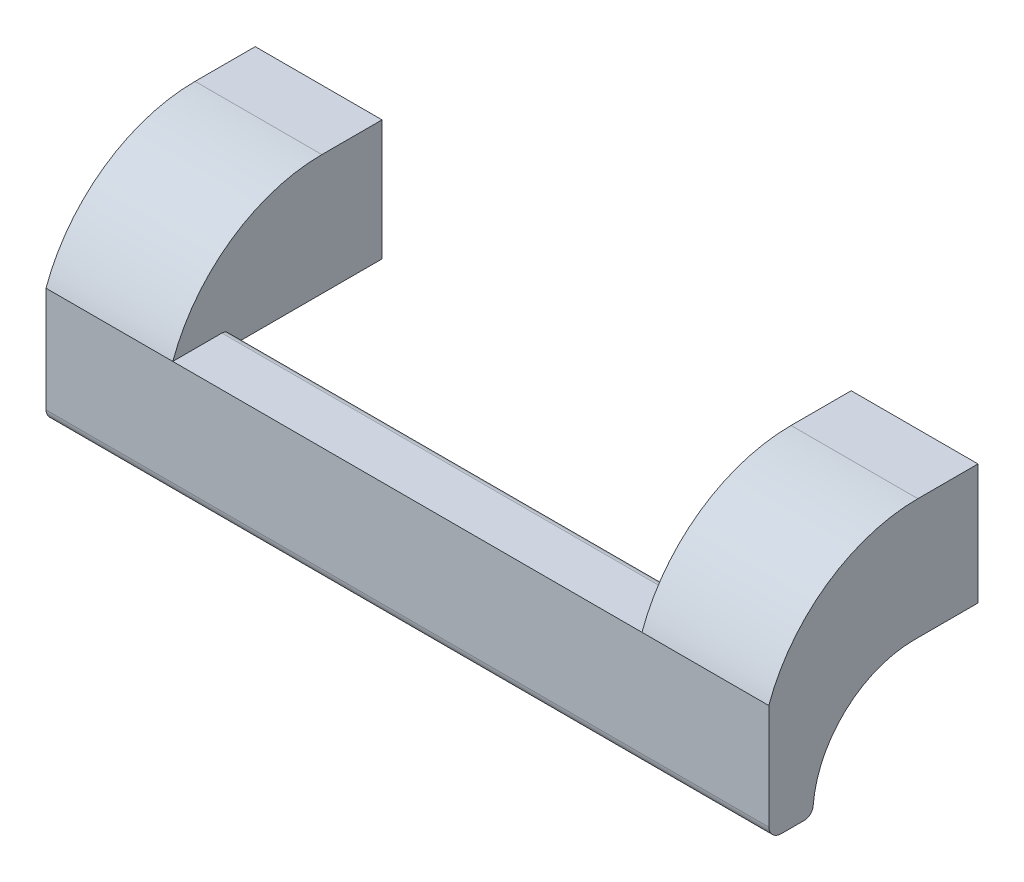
ISO-10303-21;
HEADER;
FILE_DESCRIPTION(('STEP AP214'),'2;1');
FILE_NAME('part.step','',(''),(''),'','','');
FILE_SCHEMA(('AUTOMOTIVE_DESIGN { 1 0 10303 214 1 1 1 1 }'));
ENDSEC;
DATA;
#1=APPLICATION_CONTEXT('core data for automotive mechanical design processes');
#2=APPLICATION_PROTOCOL_DEFINITION('international standard','automotive_design',2000,#1);
#3=PRODUCT_CONTEXT('',#1,'mechanical');
#4=PRODUCT('Part','Part','',(#3));
#5=PRODUCT_RELATED_PRODUCT_CATEGORY('part','',(#4));
#6=PRODUCT_DEFINITION_FORMATION('','',#4);
#7=PRODUCT_DEFINITION_CONTEXT('part definition',#1,'design');
#8=PRODUCT_DEFINITION('design','',#6,#7);
#9=PRODUCT_DEFINITION_SHAPE('','',#8);
#10=(LENGTH_UNIT() NAMED_UNIT(*) SI_UNIT(.MILLI.,.METRE.));
#11=(NAMED_UNIT(*) PLANE_ANGLE_UNIT() SI_UNIT($,.RADIAN.));
#12=(NAMED_UNIT(*) SI_UNIT($,.STERADIAN.) SOLID_ANGLE_UNIT());
#13=UNCERTAINTY_MEASURE_WITH_UNIT(LENGTH_MEASURE(1.E-05),#10,'distance_accuracy_value','');
#14=(GEOMETRIC_REPRESENTATION_CONTEXT(3) GLOBAL_UNCERTAINTY_ASSIGNED_CONTEXT((#13)) GLOBAL_UNIT_ASSIGNED_CONTEXT((#10,
#11,#12)) REPRESENTATION_CONTEXT('',''));
#15=CARTESIAN_POINT('',(0.,0.,0.));
#16=DIRECTION('',(0.,0.,1.));
#17=DIRECTION('',(1.,0.,0.));
#18=AXIS2_PLACEMENT_3D('',#15,#16,#17);
#19=CARTESIAN_POINT('',(93.5,8.66025403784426,11.));
#20=DIRECTION('',(0.,0.,-1.));
#21=DIRECTION('',(0.,1.,0.));
#22=AXIS2_PLACEMENT_3D('',#19,#20,#21);
#23=PLANE('',#22);
#24=DIRECTION('',(0.5,0.866025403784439,0.));
#25=VECTOR('',#24,1.);
#26=CARTESIAN_POINT('',(99.2735026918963,2.09368185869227E-13,11.));
#27=LINE('',#26,#25);
#28=CARTESIAN_POINT('',(99.2735026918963,1.88847396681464E-13,11.));
#29=VERTEX_POINT('',#28);
#30=CARTESIAN_POINT('',(96.3867513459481,-4.99999999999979,11.0000000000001));
#31=VERTEX_POINT('',#30);
#32=EDGE_CURVE('E454',#29,#31,#27,.F.);
#33=ORIENTED_EDGE('',*,*,#32,.T.);
#34=DIRECTION('',(1.,0.,0.));
#35=VECTOR('',#34,1.);
#36=CARTESIAN_POINT('',(96.3867513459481,-4.99999999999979,11.0000000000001));
#37=LINE('',#36,#35);
#38=CARTESIAN_POINT('',(90.6132486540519,-4.9999999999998,11.0000000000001));
#39=VERTEX_POINT('',#38);
#40=EDGE_CURVE('E447',#31,#39,#37,.F.);
#41=ORIENTED_EDGE('',*,*,#40,.T.);
#42=DIRECTION('',(0.5,-0.866025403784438,0.));
#43=VECTOR('',#42,1.);
#44=CARTESIAN_POINT('',(90.6132486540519,-4.99999999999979,11.0000000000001));
#45=LINE('',#44,#43);
#46=CARTESIAN_POINT('',(87.7264973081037,2.07278833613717E-13,11.0000000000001));
#47=VERTEX_POINT('',#46);
#48=EDGE_CURVE('E222',#39,#47,#45,.F.);
#49=ORIENTED_EDGE('',*,*,#48,.T.);
#50=DIRECTION('',(-0.5,-0.866025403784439,0.));
#51=VECTOR('',#50,1.);
#52=CARTESIAN_POINT('',(87.7264973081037,2.24980697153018E-13,11.));
#53=LINE('',#52,#51);
#54=CARTESIAN_POINT('',(90.6132486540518,5.00000000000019,11.));
#55=VERTEX_POINT('',#54);
#56=EDGE_CURVE('E217',#47,#55,#53,.F.);
#57=ORIENTED_EDGE('',*,*,#56,.T.);
#58=DIRECTION('',(1.,0.,0.));
#59=VECTOR('',#58,1.);
#60=CARTESIAN_POINT('',(90.6132486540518,5.00000000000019,10.9999999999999));
#61=LINE('',#60,#59);
#62=CARTESIAN_POINT('',(96.3867513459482,5.00000000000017,10.9999999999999));
#63=VERTEX_POINT('',#62);
#64=EDGE_CURVE('E219',#55,#63,#61,.T.);
#65=ORIENTED_EDGE('',*,*,#64,.T.);
#66=DIRECTION('',(-0.499999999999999,0.866025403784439,0.));
#67=VECTOR('',#66,1.);
#68=CARTESIAN_POINT('',(96.3867513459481,5.00000000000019,10.9999999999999));
#69=LINE('',#68,#67);
#70=EDGE_CURVE('E461',#63,#29,#69,.F.);
#71=ORIENTED_EDGE('',*,*,#70,.T.);
#72=EDGE_LOOP('',(#33,#41,#49,#57,#65,#71));
#73=FACE_BOUND('',#72,.T.);
#74=ADVANCED_FACE('F14',(#73),#23,.T.);
#75=CARTESIAN_POINT('',(0.,8.66025403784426,11.));
#76=DIRECTION('',(0.,0.,-1.));
#77=DIRECTION('',(0.,1.,0.));
#78=AXIS2_PLACEMENT_3D('',#75,#76,#77);
#79=PLANE('',#78);
#80=DIRECTION('',(0.5,0.866025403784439,0.));
#81=VECTOR('',#80,1.);
#82=CARTESIAN_POINT('',(5.77350269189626,2.16740760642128E-13,11.));
#83=LINE('',#82,#81);
#84=CARTESIAN_POINT('',(5.77350269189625,1.98001642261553E-13,11.));
#85=VERTEX_POINT('',#84);
#86=CARTESIAN_POINT('',(2.88675134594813,-4.99999999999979,11.0000000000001));
#87=VERTEX_POINT('',#86);
#88=EDGE_CURVE('E414',#85,#87,#83,.F.);
#89=ORIENTED_EDGE('',*,*,#88,.T.);
#90=DIRECTION('',(1.,0.,0.));
#91=VECTOR('',#90,1.);
#92=CARTESIAN_POINT('',(2.88675134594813,-4.99999999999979,11.0000000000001));
#93=LINE('',#92,#91);
#94=CARTESIAN_POINT('',(-2.88675134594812,-4.9999999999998,11.0000000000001));
#95=VERTEX_POINT('',#94);
#96=EDGE_CURVE('E407',#87,#95,#93,.F.);
#97=ORIENTED_EDGE('',*,*,#96,.T.);
#98=DIRECTION('',(0.5,-0.866025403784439,0.));
#99=VECTOR('',#98,1.);
#100=CARTESIAN_POINT('',(-2.88675134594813,-4.99999999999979,11.0000000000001));
#101=LINE('',#100,#99);
#102=CARTESIAN_POINT('',(-5.77350269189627,2.00686988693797E-13,11.0000000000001));
#103=VERTEX_POINT('',#102);
#104=EDGE_CURVE('E401',#95,#103,#101,.F.);
#105=ORIENTED_EDGE('',*,*,#104,.T.);
#106=DIRECTION('',(-0.5,-0.866025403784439,0.));
#107=VECTOR('',#106,1.);
#108=CARTESIAN_POINT('',(-5.77350269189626,2.18475484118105E-13,11.));
#109=LINE('',#108,#107);
#110=CARTESIAN_POINT('',(-2.88675134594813,5.00000000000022,11.));
#111=VERTEX_POINT('',#110);
#112=EDGE_CURVE('E435',#103,#111,#109,.F.);
#113=ORIENTED_EDGE('',*,*,#112,.T.);
#114=DIRECTION('',(1.,0.,0.));
#115=VECTOR('',#114,1.);
#116=CARTESIAN_POINT('',(-2.88675134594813,5.00000000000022,10.9999999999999));
#117=LINE('',#116,#115);
#118=CARTESIAN_POINT('',(2.88675134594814,5.0000000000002,10.9999999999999));
#119=VERTEX_POINT('',#118);
#120=EDGE_CURVE('E428',#111,#119,#117,.T.);
#121=ORIENTED_EDGE('',*,*,#120,.T.);
#122=DIRECTION('',(-0.5,0.866025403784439,0.));
#123=VECTOR('',#122,1.);
#124=CARTESIAN_POINT('',(2.88675134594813,5.00000000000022,10.9999999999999));
#125=LINE('',#124,#123);
#126=EDGE_CURVE('E421',#119,#85,#125,.F.);
#127=ORIENTED_EDGE('',*,*,#126,.T.);
#128=EDGE_LOOP('',(#89,#97,#105,#113,#121,#127));
#129=FACE_BOUND('',#128,.T.);
#130=ADVANCED_FACE('F1110',(#129),#79,.T.);
#131=CARTESIAN_POINT('',(87.7264973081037,2.24980697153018E-13,11.));
#132=DIRECTION('',(-0.866025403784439,0.5,0.));
#133=DIRECTION('',(-0.5,-0.866025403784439,0.));
#134=AXIS2_PLACEMENT_3D('',#131,#132,#133);
#135=PLANE('',#134);
#136=DIRECTION('',(0.,0.,1.));
#137=VECTOR('',#136,1.);
#138=CARTESIAN_POINT('',(90.6132486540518,5.00000000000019,10.9999999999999));
#139=LINE('',#138,#137);
#140=CARTESIAN_POINT('',(90.6132486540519,5.00000000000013,5.99999999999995));
#141=VERTEX_POINT('',#140);
#142=EDGE_CURVE('E228',#141,#55,#139,.T.);
#143=ORIENTED_EDGE('',*,*,#142,.T.);
#144=ORIENTED_EDGE('',*,*,#56,.F.);
#145=DIRECTION('',(0.,0.,1.));
#146=VECTOR('',#145,1.);
#147=CARTESIAN_POINT('',(87.7264973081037,2.25514051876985E-13,11.0000000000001));
#148=LINE('',#147,#146);
#149=CARTESIAN_POINT('',(87.7264973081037,1.44794539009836E-13,6.));
#150=VERTEX_POINT('',#149);
#151=EDGE_CURVE('E438',#47,#150,#148,.F.);
#152=ORIENTED_EDGE('',*,*,#151,.T.);
#153=DIRECTION('',(0.5,0.866025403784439,0.));
#154=VECTOR('',#153,1.);
#155=CARTESIAN_POINT('',(87.7264973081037,1.26634813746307E-13,6.00000000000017));
#156=LINE('',#155,#154);
#157=EDGE_CURVE('E240',#150,#141,#156,.T.);
#158=ORIENTED_EDGE('',*,*,#157,.T.);
#159=EDGE_LOOP('',(#143,#144,#152,#158));
#160=FACE_BOUND('',#159,.T.);
#161=ADVANCED_FACE('F239',(#160),#135,.F.);
#162=CARTESIAN_POINT('',(90.6132486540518,5.00000000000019,10.9999999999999));
#163=DIRECTION('',(0.,1.,0.));
#164=DIRECTION('',(0.,0.,1.));
#165=AXIS2_PLACEMENT_3D('',#162,#163,#164);
#166=PLANE('',#165);
#167=DIRECTION('',(0.,0.,1.));
#168=VECTOR('',#167,1.);
#169=CARTESIAN_POINT('',(96.3867513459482,5.00000000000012,10.9999999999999));
#170=LINE('',#169,#168);
#171=CARTESIAN_POINT('',(96.3867513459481,5.0000000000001,5.99999999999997));
#172=VERTEX_POINT('',#171);
#173=EDGE_CURVE('E235',#172,#63,#170,.T.);
#174=ORIENTED_EDGE('',*,*,#173,.T.);
#175=ORIENTED_EDGE('',*,*,#64,.F.);
#176=ORIENTED_EDGE('',*,*,#142,.F.);
#177=DIRECTION('',(1.,0.,0.));
#178=VECTOR('',#177,1.);
#179=CARTESIAN_POINT('',(93.5,5.0000000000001,6.00000000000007));
#180=LINE('',#179,#178);
#181=EDGE_CURVE('E392',#141,#172,#180,.T.);
#182=ORIENTED_EDGE('',*,*,#181,.T.);
#183=EDGE_LOOP('',(#174,#175,#176,#182));
#184=FACE_BOUND('',#183,.T.);
#185=ADVANCED_FACE('F232',(#184),#166,.F.);
#186=CARTESIAN_POINT('',(96.3867513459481,5.00000000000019,10.9999999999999));
#187=DIRECTION('',(0.866025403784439,0.499999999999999,0.));
#188=DIRECTION('',(-0.499999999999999,0.866025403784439,0.));
#189=AXIS2_PLACEMENT_3D('',#186,#187,#188);
#190=PLANE('',#189);
#191=DIRECTION('',(0.,0.,1.));
#192=VECTOR('',#191,1.);
#193=CARTESIAN_POINT('',(99.2735026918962,1.35183598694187E-13,11.));
#194=LINE('',#193,#192);
#195=CARTESIAN_POINT('',(99.2735026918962,1.45285381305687E-13,6.00000000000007));
#196=VERTEX_POINT('',#195);
#197=EDGE_CURVE('E457',#196,#29,#194,.T.);
#198=ORIENTED_EDGE('',*,*,#197,.T.);
#199=ORIENTED_EDGE('',*,*,#70,.F.);
#200=ORIENTED_EDGE('',*,*,#173,.F.);
#201=DIRECTION('',(0.500000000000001,-0.866025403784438,0.));
#202=VECTOR('',#201,1.);
#203=CARTESIAN_POINT('',(96.3867513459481,5.0000000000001,6.00000000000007));
#204=LINE('',#203,#202);
#205=EDGE_CURVE('E388',#172,#196,#204,.T.);
#206=ORIENTED_EDGE('',*,*,#205,.T.);
#207=EDGE_LOOP('',(#198,#199,#200,#206));
#208=FACE_BOUND('',#207,.T.);
#209=ADVANCED_FACE('F1086',(#208),#190,.F.);
#210=CARTESIAN_POINT('',(99.2735026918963,2.09368185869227E-13,11.));
#211=DIRECTION('',(0.866025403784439,-0.5,0.));
#212=DIRECTION('',(0.5,0.866025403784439,0.));
#213=AXIS2_PLACEMENT_3D('',#210,#211,#212);
#214=PLANE('',#213);
#215=DIRECTION('',(0.,0.,-1.));
#216=VECTOR('',#215,1.);
#217=CARTESIAN_POINT('',(96.3867513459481,-4.99999999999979,11.0000000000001));
#218=LINE('',#217,#216);
#219=CARTESIAN_POINT('',(96.3867513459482,-4.99999999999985,6.00000000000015));
#220=VERTEX_POINT('',#219);
#221=EDGE_CURVE('E450',#220,#31,#218,.F.);
#222=ORIENTED_EDGE('',*,*,#221,.T.);
#223=ORIENTED_EDGE('',*,*,#32,.F.);
#224=ORIENTED_EDGE('',*,*,#197,.F.);
#225=DIRECTION('',(-0.500000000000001,-0.866025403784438,0.));
#226=VECTOR('',#225,1.);
#227=CARTESIAN_POINT('',(99.2735026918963,1.11022302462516E-13,6.00000000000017));
#228=LINE('',#227,#226);
#229=EDGE_CURVE('E384',#196,#220,#228,.T.);
#230=ORIENTED_EDGE('',*,*,#229,.T.);
#231=EDGE_LOOP('',(#222,#223,#224,#230));
#232=FACE_BOUND('',#231,.T.);
#233=ADVANCED_FACE('F1077',(#232),#214,.F.);
#234=CARTESIAN_POINT('',(96.3867513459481,-4.99999999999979,11.0000000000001));
#235=DIRECTION('',(0.,-1.,0.));
#236=DIRECTION('',(0.,0.,-1.));
#237=AXIS2_PLACEMENT_3D('',#234,#235,#236);
#238=PLANE('',#237);
#239=DIRECTION('',(0.,0.,1.));
#240=VECTOR('',#239,1.);
#241=CARTESIAN_POINT('',(90.6132486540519,-4.99999999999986,11.0000000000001));
#242=LINE('',#241,#240);
#243=CARTESIAN_POINT('',(90.6132486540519,-4.99999999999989,6.00000000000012));
#244=VERTEX_POINT('',#243);
#245=EDGE_CURVE('E443',#244,#39,#242,.T.);
#246=ORIENTED_EDGE('',*,*,#245,.T.);
#247=ORIENTED_EDGE('',*,*,#40,.F.);
#248=ORIENTED_EDGE('',*,*,#221,.F.);
#249=DIRECTION('',(1.,0.,0.));
#250=VECTOR('',#249,1.);
#251=CARTESIAN_POINT('',(93.5,-4.99999999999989,6.00000000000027));
#252=LINE('',#251,#250);
#253=EDGE_CURVE('E380',#220,#244,#252,.F.);
#254=ORIENTED_EDGE('',*,*,#253,.T.);
#255=EDGE_LOOP('',(#246,#247,#248,#254));
#256=FACE_BOUND('',#255,.T.);
#257=ADVANCED_FACE('F1068',(#256),#238,.F.);
#258=CARTESIAN_POINT('',(90.6132486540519,-4.99999999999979,11.0000000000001));
#259=DIRECTION('',(-0.866025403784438,-0.5,0.));
#260=DIRECTION('',(0.5,-0.866025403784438,0.));
#261=AXIS2_PLACEMENT_3D('',#258,#259,#260);
#262=PLANE('',#261);
#263=ORIENTED_EDGE('',*,*,#151,.F.);
#264=ORIENTED_EDGE('',*,*,#48,.F.);
#265=ORIENTED_EDGE('',*,*,#245,.F.);
#266=DIRECTION('',(-0.5,0.866025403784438,0.));
#267=VECTOR('',#266,1.);
#268=CARTESIAN_POINT('',(90.6132486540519,-4.99999999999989,6.00000000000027));
#269=LINE('',#268,#267);
#270=EDGE_CURVE('E376',#244,#150,#269,.T.);
#271=ORIENTED_EDGE('',*,*,#270,.T.);
#272=EDGE_LOOP('',(#263,#264,#265,#271));
#273=FACE_BOUND('',#272,.T.);
#274=ADVANCED_FACE('F1059',(#273),#262,.F.);
#275=CARTESIAN_POINT('',(-5.77350269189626,2.18475484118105E-13,11.));
#276=DIRECTION('',(-0.866025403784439,0.5,0.));
#277=DIRECTION('',(-0.5,-0.866025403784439,0.));
#278=AXIS2_PLACEMENT_3D('',#275,#276,#277);
#279=PLANE('',#278);
#280=DIRECTION('',(0.,0.,1.));
#281=VECTOR('',#280,1.);
#282=CARTESIAN_POINT('',(-2.88675134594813,5.00000000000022,10.9999999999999));
#283=LINE('',#282,#281);
#284=CARTESIAN_POINT('',(-2.88675134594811,5.00000000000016,5.99999999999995));
#285=VERTEX_POINT('',#284);
#286=EDGE_CURVE('E431',#285,#111,#283,.T.);
#287=ORIENTED_EDGE('',*,*,#286,.T.);
#288=ORIENTED_EDGE('',*,*,#112,.F.);
#289=DIRECTION('',(0.,0.,1.));
#290=VECTOR('',#289,1.);
#291=CARTESIAN_POINT('',(-5.77350269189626,2.18575157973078E-13,11.0000000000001));
#292=LINE('',#291,#290);
#293=CARTESIAN_POINT('',(-5.77350269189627,1.38166380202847E-13,6.));
#294=VERTEX_POINT('',#293);
#295=EDGE_CURVE('E397',#103,#294,#292,.F.);
#296=ORIENTED_EDGE('',*,*,#295,.T.);
#297=DIRECTION('',(0.5,0.866025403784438,0.));
#298=VECTOR('',#297,1.);
#299=CARTESIAN_POINT('',(-5.77350269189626,1.196959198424E-13,6.00000000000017));
#300=LINE('',#299,#298);
#301=EDGE_CURVE('E372',#294,#285,#300,.T.);
#302=ORIENTED_EDGE('',*,*,#301,.T.);
#303=EDGE_LOOP('',(#287,#288,#296,#302));
#304=FACE_BOUND('',#303,.T.);
#305=ADVANCED_FACE('F1050',(#304),#279,.F.);
#306=CARTESIAN_POINT('',(-2.88675134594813,5.00000000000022,10.9999999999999));
#307=DIRECTION('',(0.,1.,0.));
#308=DIRECTION('',(0.,0.,1.));
#309=AXIS2_PLACEMENT_3D('',#306,#307,#308);
#310=PLANE('',#309);
#311=DIRECTION('',(0.,0.,1.));
#312=VECTOR('',#311,1.);
#313=CARTESIAN_POINT('',(2.88675134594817,5.00000000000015,10.9999999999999));
#314=LINE('',#313,#312);
#315=CARTESIAN_POINT('',(2.88675134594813,5.00000000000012,5.99999999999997));
#316=VERTEX_POINT('',#315);
#317=EDGE_CURVE('E424',#316,#119,#314,.T.);
#318=ORIENTED_EDGE('',*,*,#317,.T.);
#319=ORIENTED_EDGE('',*,*,#120,.F.);
#320=ORIENTED_EDGE('',*,*,#286,.F.);
#321=DIRECTION('',(1.,0.,0.));
#322=VECTOR('',#321,1.);
#323=CARTESIAN_POINT('',(0.,5.00000000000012,6.00000000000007));
#324=LINE('',#323,#322);
#325=EDGE_CURVE('E369',#285,#316,#324,.T.);
#326=ORIENTED_EDGE('',*,*,#325,.T.);
#327=EDGE_LOOP('',(#318,#319,#320,#326));
#328=FACE_BOUND('',#327,.T.);
#329=ADVANCED_FACE('F1041',(#328),#310,.F.);
#330=CARTESIAN_POINT('',(2.88675134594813,5.00000000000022,10.9999999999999));
#331=DIRECTION('',(0.866025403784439,0.5,0.));
#332=DIRECTION('',(-0.5,0.866025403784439,0.));
#333=AXIS2_PLACEMENT_3D('',#330,#331,#332);
#334=PLANE('',#333);
#335=DIRECTION('',(0.,0.,1.));
#336=VECTOR('',#335,1.);
#337=CARTESIAN_POINT('',(5.77350269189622,1.42556173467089E-13,11.));
#338=LINE('',#337,#336);
#339=CARTESIAN_POINT('',(5.77350269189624,1.54629362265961E-13,6.00000000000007));
#340=VERTEX_POINT('',#339);
#341=EDGE_CURVE('E417',#340,#85,#338,.T.);
#342=ORIENTED_EDGE('',*,*,#341,.T.);
#343=ORIENTED_EDGE('',*,*,#126,.F.);
#344=ORIENTED_EDGE('',*,*,#317,.F.);
#345=DIRECTION('',(0.5,-0.866025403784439,0.));
#346=VECTOR('',#345,1.);
#347=CARTESIAN_POINT('',(2.88675134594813,5.00000000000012,6.00000000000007));
#348=LINE('',#347,#346);
#349=EDGE_CURVE('E366',#316,#340,#348,.T.);
#350=ORIENTED_EDGE('',*,*,#349,.T.);
#351=EDGE_LOOP('',(#342,#343,#344,#350));
#352=FACE_BOUND('',#351,.T.);
#353=ADVANCED_FACE('F1032',(#352),#334,.F.);
#354=CARTESIAN_POINT('',(5.77350269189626,2.16740760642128E-13,11.));
#355=DIRECTION('',(0.866025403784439,-0.5,0.));
#356=DIRECTION('',(0.5,0.866025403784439,0.));
#357=AXIS2_PLACEMENT_3D('',#354,#355,#356);
#358=PLANE('',#357);
#359=DIRECTION('',(0.,0.,-1.));
#360=VECTOR('',#359,1.);
#361=CARTESIAN_POINT('',(2.88675134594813,-4.99999999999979,11.0000000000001));
#362=LINE('',#361,#360);
#363=CARTESIAN_POINT('',(2.88675134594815,-4.99999999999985,6.00000000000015));
#364=VERTEX_POINT('',#363);
#365=EDGE_CURVE('E410',#364,#87,#362,.F.);
#366=ORIENTED_EDGE('',*,*,#365,.T.);
#367=ORIENTED_EDGE('',*,*,#88,.F.);
#368=ORIENTED_EDGE('',*,*,#341,.F.);
#369=DIRECTION('',(-0.5,-0.866025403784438,0.));
#370=VECTOR('',#369,1.);
#371=CARTESIAN_POINT('',(5.77350269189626,1.17961196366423E-13,6.00000000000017));
#372=LINE('',#371,#370);
#373=EDGE_CURVE('E360',#340,#364,#372,.T.);
#374=ORIENTED_EDGE('',*,*,#373,.T.);
#375=EDGE_LOOP('',(#366,#367,#368,#374));
#376=FACE_BOUND('',#375,.T.);
#377=ADVANCED_FACE('F1023',(#376),#358,.F.);
#378=CARTESIAN_POINT('',(2.88675134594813,-4.99999999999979,11.0000000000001));
#379=DIRECTION('',(0.,-1.,0.));
#380=DIRECTION('',(0.,0.,-1.));
#381=AXIS2_PLACEMENT_3D('',#378,#379,#380);
#382=PLANE('',#381);
#383=DIRECTION('',(0.,0.,1.));
#384=VECTOR('',#383,1.);
#385=CARTESIAN_POINT('',(-2.88675134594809,-4.99999999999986,11.0000000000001));
#386=LINE('',#385,#384);
#387=CARTESIAN_POINT('',(-2.88675134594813,-4.99999999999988,6.00000000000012));
#388=VERTEX_POINT('',#387);
#389=EDGE_CURVE('E144',#388,#95,#386,.T.);
#390=ORIENTED_EDGE('',*,*,#389,.T.);
#391=ORIENTED_EDGE('',*,*,#96,.F.);
#392=ORIENTED_EDGE('',*,*,#365,.F.);
#393=DIRECTION('',(1.,0.,0.));
#394=VECTOR('',#393,1.);
#395=CARTESIAN_POINT('',(0.,-4.99999999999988,6.00000000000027));
#396=LINE('',#395,#394);
#397=EDGE_CURVE('E355',#364,#388,#396,.F.);
#398=ORIENTED_EDGE('',*,*,#397,.T.);
#399=EDGE_LOOP('',(#390,#391,#392,#398));
#400=FACE_BOUND('',#399,.T.);
#401=ADVANCED_FACE('F1015',(#400),#382,.F.);
#402=CARTESIAN_POINT('',(-2.88675134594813,-4.99999999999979,11.0000000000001));
#403=DIRECTION('',(-0.866025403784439,-0.5,0.));
#404=DIRECTION('',(0.5,-0.866025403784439,0.));
#405=AXIS2_PLACEMENT_3D('',#402,#403,#404);
#406=PLANE('',#405);
#407=ORIENTED_EDGE('',*,*,#295,.F.);
#408=ORIENTED_EDGE('',*,*,#104,.F.);
#409=ORIENTED_EDGE('',*,*,#389,.F.);
#410=DIRECTION('',(-0.5,0.866025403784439,0.));
#411=VECTOR('',#410,1.);
#412=CARTESIAN_POINT('',(-2.88675134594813,-4.99999999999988,6.00000000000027));
#413=LINE('',#412,#411);
#414=EDGE_CURVE('E349',#388,#294,#413,.T.);
#415=ORIENTED_EDGE('',*,*,#414,.T.);
#416=EDGE_LOOP('',(#407,#408,#409,#415));
#417=FACE_BOUND('',#416,.T.);
#418=ADVANCED_FACE('F778',(#417),#406,.F.);
#419=CARTESIAN_POINT('',(93.5,8.66025403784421,6.));
#420=DIRECTION('',(0.,0.,-1.));
#421=DIRECTION('',(0.,1.,0.));
#422=AXIS2_PLACEMENT_3D('',#419,#420,#421);
#423=PLANE('',#422);
#424=ORIENTED_EDGE('',*,*,#253,.F.);
#425=ORIENTED_EDGE('',*,*,#229,.F.);
#426=ORIENTED_EDGE('',*,*,#205,.F.);
#427=ORIENTED_EDGE('',*,*,#181,.F.);
#428=ORIENTED_EDGE('',*,*,#157,.F.);
#429=ORIENTED_EDGE('',*,*,#270,.F.);
#430=EDGE_LOOP('',(#424,#425,#426,#427,#428,#429));
#431=FACE_BOUND('',#430,.T.);
#432=CARTESIAN_POINT('',(93.5,1.66533453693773E-13,6.0000000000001));
#433=DIRECTION('',(0.,0.,-1.));
#434=DIRECTION('',(0.,1.,0.));
#435=AXIS2_PLACEMENT_3D('',#432,#433,#434);
#436=CIRCLE('',#435,3.24999999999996);
#437=CARTESIAN_POINT('',(93.5,3.25000000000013,6.00000000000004));
#438=VERTEX_POINT('',#437);
#439=EDGE_CURVE('E336',#438,#438,#436,.T.);
#440=ORIENTED_EDGE('',*,*,#439,.T.);
#441=EDGE_LOOP('',(#440));
#442=FACE_BOUND('',#441,.T.);
#443=ADVANCED_FACE('F769',(#431,#442),#423,.F.);
#444=CARTESIAN_POINT('',(0.,8.66025403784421,6.));
#445=DIRECTION('',(0.,0.,-1.));
#446=DIRECTION('',(0.,1.,0.));
#447=AXIS2_PLACEMENT_3D('',#444,#445,#446);
#448=PLANE('',#447);
#449=ORIENTED_EDGE('',*,*,#397,.F.);
#450=ORIENTED_EDGE('',*,*,#373,.F.);
#451=ORIENTED_EDGE('',*,*,#349,.F.);
#452=ORIENTED_EDGE('',*,*,#325,.F.);
#453=ORIENTED_EDGE('',*,*,#301,.F.);
#454=ORIENTED_EDGE('',*,*,#414,.F.);
#455=EDGE_LOOP('',(#449,#450,#451,#452,#453,#454));
#456=FACE_BOUND('',#455,.T.);
#457=CARTESIAN_POINT('',(0.,1.66533453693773E-13,6.0000000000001));
#458=DIRECTION('',(0.,0.,-1.));
#459=DIRECTION('',(0.,1.,0.));
#460=AXIS2_PLACEMENT_3D('',#457,#458,#459);
#461=CIRCLE('',#460,3.24999999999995);
#462=CARTESIAN_POINT('',(0.,3.25000000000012,6.00000000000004));
#463=VERTEX_POINT('',#462);
#464=EDGE_CURVE('E331',#463,#463,#461,.T.);
#465=ORIENTED_EDGE('',*,*,#464,.T.);
#466=EDGE_LOOP('',(#465));
#467=FACE_BOUND('',#466,.T.);
#468=ADVANCED_FACE('F767',(#456,#467),#448,.F.);
#469=CARTESIAN_POINT('',(101.25,-23.,29.5000000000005));
#470=DIRECTION('',(-1.,0.,0.));
#471=DIRECTION('',(0.,0.,1.));
#472=AXIS2_PLACEMENT_3D('',#469,#470,#471);
#473=CYLINDRICAL_SURFACE('',#472,0.500000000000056);
#474=CARTESIAN_POINT('',(-7.75000000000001,-23.,29.5000000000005));
#475=DIRECTION('',(-1.,0.,0.));
#476=DIRECTION('',(0.,0.,1.));
#477=AXIS2_PLACEMENT_3D('',#474,#475,#476);
#478=CIRCLE('',#477,0.500000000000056);
#479=CARTESIAN_POINT('',(-7.75000000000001,-23.,30.0000000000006));
#480=VERTEX_POINT('',#479);
#481=CARTESIAN_POINT('',(-7.75000000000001,-23.4999999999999,29.5000000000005));
#482=VERTEX_POINT('',#481);
#483=EDGE_CURVE('E340',#480,#482,#478,.F.);
#484=ORIENTED_EDGE('',*,*,#483,.F.);
#485=DIRECTION('',(1.,0.,0.));
#486=VECTOR('',#485,1.);
#487=CARTESIAN_POINT('',(101.25,-23.,30.0000000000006));
#488=LINE('',#487,#486);
#489=CARTESIAN_POINT('',(101.25,-23.,30.0000000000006));
#490=VERTEX_POINT('',#489);
#491=EDGE_CURVE('E335',#480,#490,#488,.T.);
#492=ORIENTED_EDGE('',*,*,#491,.T.);
#493=CARTESIAN_POINT('',(101.25,-23.,29.5000000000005));
#494=DIRECTION('',(-1.,0.,0.));
#495=DIRECTION('',(0.,0.,1.));
#496=AXIS2_PLACEMENT_3D('',#493,#494,#495);
#497=CIRCLE('',#496,0.500000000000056);
#498=CARTESIAN_POINT('',(101.25,-23.4999999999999,29.5000000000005));
#499=VERTEX_POINT('',#498);
#500=EDGE_CURVE('E17',#499,#490,#497,.T.);
#501=ORIENTED_EDGE('',*,*,#500,.F.);
#502=DIRECTION('',(1.,0.,0.));
#503=VECTOR('',#502,1.);
#504=CARTESIAN_POINT('',(101.25,-23.4999999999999,29.5000000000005));
#505=LINE('',#504,#503);
#506=EDGE_CURVE('E339',#499,#482,#505,.F.);
#507=ORIENTED_EDGE('',*,*,#506,.T.);
#508=EDGE_LOOP('',(#484,#492,#501,#507));
#509=FACE_BOUND('',#508,.T.);
#510=ADVANCED_FACE('F578',(#509),#473,.F.);
#511=CARTESIAN_POINT('',(101.25,-23.5,26.7117925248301));
#512=DIRECTION('',(0.,-1.,0.));
#513=DIRECTION('',(0.,0.,-1.));
#514=AXIS2_PLACEMENT_3D('',#511,#512,#513);
#515=PLANE('',#514);
#516=DIRECTION('',(0.,0.,1.));
#517=VECTOR('',#516,1.);
#518=CARTESIAN_POINT('',(-7.75,-23.5,29.5000000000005));
#519=LINE('',#518,#517);
#520=CARTESIAN_POINT('',(-7.75000000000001,-23.5,26.7117925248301));
#521=VERTEX_POINT('',#520);
#522=EDGE_CURVE('E503',#521,#482,#519,.T.);
#523=ORIENTED_EDGE('',*,*,#522,.T.);
#524=ORIENTED_EDGE('',*,*,#506,.F.);
#525=DIRECTION('',(0.,0.,1.));
#526=VECTOR('',#525,1.);
#527=CARTESIAN_POINT('',(101.25,-23.5,29.5000000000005));
#528=LINE('',#527,#526);
#529=CARTESIAN_POINT('',(101.25,-23.5,26.7117925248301));
#530=VERTEX_POINT('',#529);
#531=EDGE_CURVE('E557',#530,#499,#528,.T.);
#532=ORIENTED_EDGE('',*,*,#531,.F.);
#533=DIRECTION('',(-1.,0.,0.));
#534=VECTOR('',#533,1.);
#535=CARTESIAN_POINT('',(101.25,-23.5000000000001,26.7117925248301));
#536=LINE('',#535,#534);
#537=EDGE_CURVE('E322',#521,#530,#536,.F.);
#538=ORIENTED_EDGE('',*,*,#537,.F.);
#539=EDGE_LOOP('',(#523,#524,#532,#538));
#540=FACE_BOUND('',#539,.T.);
#541=ADVANCED_FACE('F729',(#540),#515,.F.);
#542=CARTESIAN_POINT('',(93.5,1.66533453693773E-13,6.0000000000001));
#543=DIRECTION('',(0.,0.,-1.));
#544=DIRECTION('',(0.,1.,0.));
#545=AXIS2_PLACEMENT_3D('',#542,#543,#544);
#546=CYLINDRICAL_SURFACE('',#545,3.24999999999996);
#547=CARTESIAN_POINT('',(93.5,0.,0.));
#548=DIRECTION('',(0.,0.,-1.));
#549=DIRECTION('',(0.,1.,0.));
#550=AXIS2_PLACEMENT_3D('',#547,#548,#549);
#551=CIRCLE('',#550,3.24999999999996);
#552=CARTESIAN_POINT('',(93.5,3.25000000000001,0.));
#553=VERTEX_POINT('',#552);
#554=EDGE_CURVE('E309',#553,#553,#551,.F.);
#555=ORIENTED_EDGE('',*,*,#554,.F.);
#556=EDGE_LOOP('',(#555));
#557=FACE_BOUND('',#556,.T.);
#558=ORIENTED_EDGE('',*,*,#439,.F.);
#559=EDGE_LOOP('',(#558));
#560=FACE_BOUND('',#559,.T.);
#561=ADVANCED_FACE('F763',(#557,#560),#546,.F.);
#562=CARTESIAN_POINT('',(0.,1.66533453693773E-13,6.0000000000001));
#563=DIRECTION('',(0.,0.,-1.));
#564=DIRECTION('',(0.,1.,0.));
#565=AXIS2_PLACEMENT_3D('',#562,#563,#564);
#566=CYLINDRICAL_SURFACE('',#565,3.24999999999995);
#567=CARTESIAN_POINT('',(0.,0.,0.));
#568=DIRECTION('',(0.,0.,-1.));
#569=DIRECTION('',(0.,1.,0.));
#570=AXIS2_PLACEMENT_3D('',#567,#568,#569);
#571=CIRCLE('',#570,3.24999999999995);
#572=CARTESIAN_POINT('',(0.,3.25,0.));
#573=VERTEX_POINT('',#572);
#574=EDGE_CURVE('E298',#573,#573,#571,.F.);
#575=ORIENTED_EDGE('',*,*,#574,.F.);
#576=EDGE_LOOP('',(#575));
#577=FACE_BOUND('',#576,.T.);
#578=ORIENTED_EDGE('',*,*,#464,.F.);
#579=EDGE_LOOP('',(#578));
#580=FACE_BOUND('',#579,.T.);
#581=ADVANCED_FACE('F760',(#577,#580),#566,.F.);
#582=CARTESIAN_POINT('',(101.25,-23.,30.0000000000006));
#583=DIRECTION('',(0.,0.,1.));
#584=DIRECTION('',(0.,-1.,0.));
#585=AXIS2_PLACEMENT_3D('',#582,#583,#584);
#586=PLANE('',#585);
#587=DIRECTION('',(0.,1.,0.));
#588=VECTOR('',#587,1.);
#589=CARTESIAN_POINT('',(-7.75,-23.,30.0000000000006));
#590=LINE('',#589,#588);
#591=CARTESIAN_POINT('',(-7.75,-9.4999999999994,30.0000000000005));
#592=VERTEX_POINT('',#591);
#593=EDGE_CURVE('E330',#480,#592,#590,.T.);
#594=ORIENTED_EDGE('',*,*,#593,.T.);
#595=DIRECTION('',(1.,0.,0.));
#596=VECTOR('',#595,1.);
#597=CARTESIAN_POINT('',(-10.25,-9.49999999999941,30.0000000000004));
#598=LINE('',#597,#596);
#599=CARTESIAN_POINT('',(101.25,-9.4999999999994,30.0000000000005));
#600=VERTEX_POINT('',#599);
#601=EDGE_CURVE('E476',#592,#600,#598,.T.);
#602=ORIENTED_EDGE('',*,*,#601,.T.);
#603=DIRECTION('',(0.,1.,0.));
#604=VECTOR('',#603,1.);
#605=CARTESIAN_POINT('',(101.25,-23.,30.0000000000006));
#606=LINE('',#605,#604);
#607=EDGE_CURVE('E505',#490,#600,#606,.T.);
#608=ORIENTED_EDGE('',*,*,#607,.F.);
#609=ORIENTED_EDGE('',*,*,#491,.F.);
#610=EDGE_LOOP('',(#594,#602,#608,#609));
#611=FACE_BOUND('',#610,.T.);
#612=ADVANCED_FACE('F580',(#611),#586,.F.);
#613=CARTESIAN_POINT('',(101.25,-23.,29.5000000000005));
#614=DIRECTION('',(-1.,0.,0.));
#615=DIRECTION('',(0.,0.,1.));
#616=AXIS2_PLACEMENT_3D('',#613,#614,#615);
#617=PLANE('',#616);
#618=DIRECTION('',(0.,0.,1.));
#619=VECTOR('',#618,1.);
#620=CARTESIAN_POINT('',(101.25,-9.5,1.94289029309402E-13));
#621=LINE('',#620,#619);
#622=CARTESIAN_POINT('',(101.25,-9.4999999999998,10.0519430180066));
#623=VERTEX_POINT('',#622);
#624=EDGE_CURVE('E498',#600,#623,#621,.F.);
#625=ORIENTED_EDGE('',*,*,#624,.T.);
#626=CARTESIAN_POINT('',(101.25,-25.5,10.0519430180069));
#627=DIRECTION('',(1.,0.,0.));
#628=DIRECTION('',(0.,0.,-1.));
#629=AXIS2_PLACEMENT_3D('',#626,#627,#628);
#630=CIRCLE('',#629,16.);
#631=CARTESIAN_POINT('',(101.25,-24.2117925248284,26.0000000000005));
#632=VERTEX_POINT('',#631);
#633=EDGE_CURVE('E304',#623,#632,#630,.T.);
#634=ORIENTED_EDGE('',*,*,#633,.T.);
#635=CARTESIAN_POINT('',(101.25,-24.2117925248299,26.7117925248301));
#636=DIRECTION('',(-1.,0.,0.));
#637=DIRECTION('',(0.,0.,1.));
#638=AXIS2_PLACEMENT_3D('',#635,#636,#637);
#639=CIRCLE('',#638,0.711792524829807);
#640=EDGE_CURVE('E327',#530,#632,#639,.T.);
#641=ORIENTED_EDGE('',*,*,#640,.F.);
#642=ORIENTED_EDGE('',*,*,#531,.T.);
#643=ORIENTED_EDGE('',*,*,#500,.T.);
#644=ORIENTED_EDGE('',*,*,#607,.T.);
#645=EDGE_LOOP('',(#625,#634,#641,#642,#643,#644));
#646=FACE_BOUND('',#645,.T.);
#647=ADVANCED_FACE('F583',(#646),#617,.T.);
#648=CARTESIAN_POINT('',(-7.75,-23.,29.5000000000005));
#649=DIRECTION('',(-1.,0.,0.));
#650=DIRECTION('',(0.,0.,1.));
#651=AXIS2_PLACEMENT_3D('',#648,#649,#650);
#652=PLANE('',#651);
#653=DIRECTION('',(0.,0.,1.));
#654=VECTOR('',#653,1.);
#655=CARTESIAN_POINT('',(-7.75,-9.5,1.94289029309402E-13));
#656=LINE('',#655,#654);
#657=CARTESIAN_POINT('',(-7.75,-9.4999999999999,10.0519430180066));
#658=VERTEX_POINT('',#657);
#659=EDGE_CURVE('E474',#658,#592,#656,.T.);
#660=ORIENTED_EDGE('',*,*,#659,.T.);
#661=ORIENTED_EDGE('',*,*,#593,.F.);
#662=ORIENTED_EDGE('',*,*,#483,.T.);
#663=ORIENTED_EDGE('',*,*,#522,.F.);
#664=CARTESIAN_POINT('',(-7.75000000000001,-24.2117925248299,26.7117925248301));
#665=DIRECTION('',(-1.,0.,0.));
#666=DIRECTION('',(0.,0.,1.));
#667=AXIS2_PLACEMENT_3D('',#664,#665,#666);
#668=CIRCLE('',#667,0.711792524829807);
#669=CARTESIAN_POINT('',(-7.75,-24.2117925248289,26.0000000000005));
#670=VERTEX_POINT('',#669);
#671=EDGE_CURVE('E323',#670,#521,#668,.F.);
#672=ORIENTED_EDGE('',*,*,#671,.F.);
#673=CARTESIAN_POINT('',(-7.75,-25.5,10.0519430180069));
#674=DIRECTION('',(1.,0.,0.));
#675=DIRECTION('',(0.,0.,-1.));
#676=AXIS2_PLACEMENT_3D('',#673,#674,#675);
#677=CIRCLE('',#676,16.);
#678=EDGE_CURVE('E292',#670,#658,#677,.F.);
#679=ORIENTED_EDGE('',*,*,#678,.T.);
#680=EDGE_LOOP('',(#660,#661,#662,#663,#672,#679));
#681=FACE_BOUND('',#680,.T.);
#682=ADVANCED_FACE('F730',(#681),#652,.F.);
#683=CARTESIAN_POINT('',(101.25,-24.2117925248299,26.7117925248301));
#684=DIRECTION('',(-1.,0.,0.));
#685=DIRECTION('',(0.,0.,1.));
#686=AXIS2_PLACEMENT_3D('',#683,#684,#685);
#687=CYLINDRICAL_SURFACE('',#686,0.711792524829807);
#688=ORIENTED_EDGE('',*,*,#671,.T.);
#689=ORIENTED_EDGE('',*,*,#537,.T.);
#690=ORIENTED_EDGE('',*,*,#640,.T.);
#691=DIRECTION('',(1.,0.,0.));
#692=VECTOR('',#691,1.);
#693=CARTESIAN_POINT('',(-10.25,-24.2117925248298,26.0000000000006));
#694=LINE('',#693,#692);
#695=EDGE_CURVE('E527',#670,#632,#694,.T.);
#696=ORIENTED_EDGE('',*,*,#695,.F.);
#697=EDGE_LOOP('',(#688,#689,#690,#696));
#698=FACE_BOUND('',#697,.T.);
#699=ADVANCED_FACE('F726',(#698),#687,.T.);
#700=CARTESIAN_POINT('',(83.75,-8.24999999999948,25.2545902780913));
#701=DIRECTION('',(-1.,0.,0.));
#702=DIRECTION('',(0.,0.,1.));
#703=AXIS2_PLACEMENT_3D('',#700,#701,#702);
#704=CYLINDRICAL_SURFACE('',#703,1.25000000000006);
#705=DIRECTION('',(1.,0.,0.));
#706=VECTOR('',#705,1.);
#707=CARTESIAN_POINT('',(83.75,-6.99999999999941,25.2545902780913));
#708=LINE('',#707,#706);
#709=CARTESIAN_POINT('',(83.75,-6.99999999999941,25.2545902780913));
#710=VERTEX_POINT('',#709);
#711=CARTESIAN_POINT('',(9.74999999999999,-6.99999999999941,25.2545902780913));
#712=VERTEX_POINT('',#711);
#713=EDGE_CURVE('E488',#710,#712,#708,.F.);
#714=ORIENTED_EDGE('',*,*,#713,.F.);
#715=CARTESIAN_POINT('',(83.75,-8.24999999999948,25.2545902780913));
#716=DIRECTION('',(-1.,0.,0.));
#717=DIRECTION('',(0.,0.,1.));
#718=AXIS2_PLACEMENT_3D('',#715,#716,#717);
#719=CIRCLE('',#718,1.25000000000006);
#720=CARTESIAN_POINT('',(83.75,-9.4999999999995,25.2545902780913));
#721=VERTEX_POINT('',#720);
#722=EDGE_CURVE('E315',#721,#710,#719,.F.);
#723=ORIENTED_EDGE('',*,*,#722,.F.);
#724=DIRECTION('',(1.,0.,0.));
#725=VECTOR('',#724,1.);
#726=CARTESIAN_POINT('',(-10.25,-9.4999999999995,25.2545902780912));
#727=LINE('',#726,#725);
#728=CARTESIAN_POINT('',(9.75,-9.4999999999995,25.2545902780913));
#729=VERTEX_POINT('',#728);
#730=EDGE_CURVE('E471',#721,#729,#727,.F.);
#731=ORIENTED_EDGE('',*,*,#730,.T.);
#732=CARTESIAN_POINT('',(9.74999999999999,-8.24999999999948,25.2545902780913));
#733=DIRECTION('',(-1.,0.,0.));
#734=DIRECTION('',(0.,0.,1.));
#735=AXIS2_PLACEMENT_3D('',#732,#733,#734);
#736=CIRCLE('',#735,1.25000000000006);
#737=EDGE_CURVE('E318',#729,#712,#736,.F.);
#738=ORIENTED_EDGE('',*,*,#737,.T.);
#739=EDGE_LOOP('',(#714,#723,#731,#738));
#740=FACE_BOUND('',#739,.T.);
#741=ADVANCED_FACE('F748',(#740),#704,.T.);
#742=CARTESIAN_POINT('',(9.75,-8.24999999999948,25.2545902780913));
#743=DIRECTION('',(-1.,0.,0.));
#744=DIRECTION('',(0.,0.,1.));
#745=AXIS2_PLACEMENT_3D('',#742,#743,#744);
#746=PLANE('',#745);
#747=ORIENTED_EDGE('',*,*,#737,.F.);
#748=DIRECTION('',(0.,0.,1.));
#749=VECTOR('',#748,1.);
#750=CARTESIAN_POINT('',(9.75,-9.5,1.94289029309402E-13));
#751=LINE('',#750,#749);
#752=CARTESIAN_POINT('',(9.75,-9.5,1.94289029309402E-13));
#753=VERTEX_POINT('',#752);
#754=EDGE_CURVE('E494',#729,#753,#751,.F.);
#755=ORIENTED_EDGE('',*,*,#754,.T.);
#756=DIRECTION('',(0.,1.,0.));
#757=VECTOR('',#756,1.);
#758=CARTESIAN_POINT('',(9.75,-9.5,1.94289029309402E-13));
#759=LINE('',#758,#757);
#760=CARTESIAN_POINT('',(9.75,9.49999999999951,-1.81190110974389E-13));
#761=VERTEX_POINT('',#760);
#762=EDGE_CURVE('E302',#761,#753,#759,.F.);
#763=ORIENTED_EDGE('',*,*,#762,.F.);
#764=DIRECTION('',(0.,0.,1.));
#765=VECTOR('',#764,1.);
#766=CARTESIAN_POINT('',(9.75,9.49999999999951,-1.80411241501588E-13));
#767=LINE('',#766,#765);
#768=CARTESIAN_POINT('',(9.75,9.49999999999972,9.4893641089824));
#769=VERTEX_POINT('',#768);
#770=EDGE_CURVE('E303',#769,#761,#767,.F.);
#771=ORIENTED_EDGE('',*,*,#770,.F.);
#772=CARTESIAN_POINT('',(9.75,-15.5000000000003,9.48936410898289));
#773=DIRECTION('',(1.,0.,0.));
#774=DIRECTION('',(0.,0.,-1.));
#775=AXIS2_PLACEMENT_3D('',#772,#773,#774);
#776=CIRCLE('',#775,25.);
#777=CARTESIAN_POINT('',(9.75,-6.99999999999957,33.0000000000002));
#778=VERTEX_POINT('',#777);
#779=EDGE_CURVE('E287',#778,#769,#776,.F.);
#780=ORIENTED_EDGE('',*,*,#779,.F.);
#781=DIRECTION('',(0.,0.,1.));
#782=VECTOR('',#781,1.);
#783=CARTESIAN_POINT('',(9.74999999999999,-6.99999999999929,34.2205294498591));
#784=LINE('',#783,#782);
#785=EDGE_CURVE('E286',#712,#778,#784,.T.);
#786=ORIENTED_EDGE('',*,*,#785,.F.);
#787=EDGE_LOOP('',(#747,#755,#763,#771,#780,#786));
#788=FACE_BOUND('',#787,.T.);
#789=ADVANCED_FACE('F751',(#788),#746,.F.);
#790=CARTESIAN_POINT('',(83.75,-8.24999999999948,25.2545902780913));
#791=DIRECTION('',(-1.,0.,0.));
#792=DIRECTION('',(0.,0.,1.));
#793=AXIS2_PLACEMENT_3D('',#790,#791,#792);
#794=PLANE('',#793);
#795=ORIENTED_EDGE('',*,*,#722,.T.);
#796=DIRECTION('',(0.,0.,1.));
#797=VECTOR('',#796,1.);
#798=CARTESIAN_POINT('',(83.75,-6.99999999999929,34.2205294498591));
#799=LINE('',#798,#797);
#800=CARTESIAN_POINT('',(83.75,-6.99999999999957,33.0000000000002));
#801=VERTEX_POINT('',#800);
#802=EDGE_CURVE('E489',#801,#710,#799,.F.);
#803=ORIENTED_EDGE('',*,*,#802,.F.);
#804=CARTESIAN_POINT('',(83.75,-15.5000000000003,9.48936410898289));
#805=DIRECTION('',(1.,0.,0.));
#806=DIRECTION('',(0.,0.,-1.));
#807=AXIS2_PLACEMENT_3D('',#804,#805,#806);
#808=CIRCLE('',#807,25.);
#809=CARTESIAN_POINT('',(83.75,9.49999999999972,9.4893641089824));
#810=VERTEX_POINT('',#809);
#811=EDGE_CURVE('E282',#810,#801,#808,.T.);
#812=ORIENTED_EDGE('',*,*,#811,.F.);
#813=DIRECTION('',(0.,0.,1.));
#814=VECTOR('',#813,1.);
#815=CARTESIAN_POINT('',(83.75,9.49999999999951,-1.80411241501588E-13));
#816=LINE('',#815,#814);
#817=CARTESIAN_POINT('',(83.75,9.49999999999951,-1.81190110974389E-13));
#818=VERTEX_POINT('',#817);
#819=EDGE_CURVE('E314',#818,#810,#816,.T.);
#820=ORIENTED_EDGE('',*,*,#819,.F.);
#821=DIRECTION('',(0.,1.,0.));
#822=VECTOR('',#821,1.);
#823=CARTESIAN_POINT('',(83.75,-9.5,1.94289029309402E-13));
#824=LINE('',#823,#822);
#825=CARTESIAN_POINT('',(83.75,-9.5,1.31838984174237E-13));
#826=VERTEX_POINT('',#825);
#827=EDGE_CURVE('E313',#826,#818,#824,.T.);
#828=ORIENTED_EDGE('',*,*,#827,.F.);
#829=DIRECTION('',(0.,0.,1.));
#830=VECTOR('',#829,1.);
#831=CARTESIAN_POINT('',(83.75,-9.5,1.94289029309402E-13));
#832=LINE('',#831,#830);
#833=EDGE_CURVE('E486',#826,#721,#832,.T.);
#834=ORIENTED_EDGE('',*,*,#833,.T.);
#835=EDGE_LOOP('',(#795,#803,#812,#820,#828,#834));
#836=FACE_BOUND('',#835,.T.);
#837=ADVANCED_FACE('F742',(#836),#794,.T.);
#838=CARTESIAN_POINT('',(-10.25,9.49999999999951,-1.80411241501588E-13));
#839=DIRECTION('',(0.,1.,0.));
#840=DIRECTION('',(0.,0.,1.));
#841=AXIS2_PLACEMENT_3D('',#838,#839,#840);
#842=PLANE('',#841);
#843=DIRECTION('',(1.,0.,0.));
#844=VECTOR('',#843,1.);
#845=CARTESIAN_POINT('',(-10.25,9.49999999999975,9.48936410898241));
#846=LINE('',#845,#844);
#847=CARTESIAN_POINT('',(103.75,9.49999999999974,9.48936410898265));
#848=VERTEX_POINT('',#847);
#849=EDGE_CURVE('E285',#848,#810,#846,.F.);
#850=ORIENTED_EDGE('',*,*,#849,.F.);
#851=DIRECTION('',(0.,0.,1.));
#852=VECTOR('',#851,1.);
#853=CARTESIAN_POINT('',(103.75,9.49999999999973,9.48936410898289));
#854=LINE('',#853,#852);
#855=CARTESIAN_POINT('',(103.75,9.49999999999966,-1.80800676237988E-13));
#856=VERTEX_POINT('',#855);
#857=EDGE_CURVE('E512',#848,#856,#854,.F.);
#858=ORIENTED_EDGE('',*,*,#857,.T.);
#859=DIRECTION('',(1.,0.,0.));
#860=VECTOR('',#859,1.);
#861=CARTESIAN_POINT('',(-10.25,9.49999999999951,-1.81579545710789E-13));
#862=LINE('',#861,#860);
#863=EDGE_CURVE('E308',#818,#856,#862,.T.);
#864=ORIENTED_EDGE('',*,*,#863,.F.);
#865=ORIENTED_EDGE('',*,*,#819,.T.);
#866=EDGE_LOOP('',(#850,#858,#864,#865));
#867=FACE_BOUND('',#866,.T.);
#868=ADVANCED_FACE('F627',(#867),#842,.T.);
#869=CARTESIAN_POINT('',(-10.25,-9.5,1.94289029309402E-13));
#870=DIRECTION('',(0.,0.,-1.));
#871=DIRECTION('',(0.,1.,0.));
#872=AXIS2_PLACEMENT_3D('',#869,#870,#871);
#873=PLANE('',#872);
#874=ORIENTED_EDGE('',*,*,#863,.T.);
#875=DIRECTION('',(0.,1.,0.));
#876=VECTOR('',#875,1.);
#877=CARTESIAN_POINT('',(103.75,-15.5000000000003,-1.80411241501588E-13));
#878=LINE('',#877,#876);
#879=CARTESIAN_POINT('',(103.75,-9.5,0.));
#880=VERTEX_POINT('',#879);
#881=EDGE_CURVE('E515',#856,#880,#878,.F.);
#882=ORIENTED_EDGE('',*,*,#881,.T.);
#883=DIRECTION('',(1.,0.,0.));
#884=VECTOR('',#883,1.);
#885=CARTESIAN_POINT('',(-10.25,-9.5,1.94289029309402E-13));
#886=LINE('',#885,#884);
#887=EDGE_CURVE('E545',#880,#826,#886,.F.);
#888=ORIENTED_EDGE('',*,*,#887,.T.);
#889=ORIENTED_EDGE('',*,*,#827,.T.);
#890=EDGE_LOOP('',(#874,#882,#888,#889));
#891=FACE_BOUND('',#890,.T.);
#892=ORIENTED_EDGE('',*,*,#554,.T.);
#893=EDGE_LOOP('',(#892));
#894=FACE_BOUND('',#893,.T.);
#895=ADVANCED_FACE('F617',(#891,#894),#873,.T.);
#896=CARTESIAN_POINT('',(-10.25,-25.5,10.0519430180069));
#897=DIRECTION('',(1.,0.,0.));
#898=DIRECTION('',(0.,0.,-1.));
#899=AXIS2_PLACEMENT_3D('',#896,#897,#898);
#900=CYLINDRICAL_SURFACE('',#899,16.);
#901=ORIENTED_EDGE('',*,*,#633,.F.);
#902=DIRECTION('',(1.,0.,0.));
#903=VECTOR('',#902,1.);
#904=CARTESIAN_POINT('',(-10.25,-9.4999999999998,10.0519430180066));
#905=LINE('',#904,#903);
#906=CARTESIAN_POINT('',(103.75,-9.4999999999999,10.0519430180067));
#907=VERTEX_POINT('',#906);
#908=EDGE_CURVE('E501',#623,#907,#905,.T.);
#909=ORIENTED_EDGE('',*,*,#908,.T.);
#910=CARTESIAN_POINT('',(103.75,-25.5,10.0519430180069));
#911=DIRECTION('',(1.,0.,0.));
#912=DIRECTION('',(0.,0.,-1.));
#913=AXIS2_PLACEMENT_3D('',#910,#911,#912);
#914=CIRCLE('',#913,16.);
#915=CARTESIAN_POINT('',(103.75,-24.21179252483,26.0000000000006));
#916=VERTEX_POINT('',#915);
#917=EDGE_CURVE('E277',#907,#916,#914,.T.);
#918=ORIENTED_EDGE('',*,*,#917,.T.);
#919=DIRECTION('',(1.,0.,0.));
#920=VECTOR('',#919,1.);
#921=CARTESIAN_POINT('',(-10.25,-24.2117925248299,26.0000000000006));
#922=LINE('',#921,#920);
#923=EDGE_CURVE('E531',#632,#916,#922,.T.);
#924=ORIENTED_EDGE('',*,*,#923,.F.);
#925=EDGE_LOOP('',(#901,#909,#918,#924));
#926=FACE_BOUND('',#925,.T.);
#927=ADVANCED_FACE('F723',(#926),#900,.F.);
#928=CARTESIAN_POINT('',(-10.25,9.49999999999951,-1.80411241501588E-13));
#929=DIRECTION('',(0.,1.,0.));
#930=DIRECTION('',(0.,0.,1.));
#931=AXIS2_PLACEMENT_3D('',#928,#929,#930);
#932=PLANE('',#931);
#933=DIRECTION('',(0.,0.,1.));
#934=VECTOR('',#933,1.);
#935=CARTESIAN_POINT('',(-10.25,9.49999999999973,9.48936410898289));
#936=LINE('',#935,#934);
#937=CARTESIAN_POINT('',(-10.25,9.49999999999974,9.48936410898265));
#938=VERTEX_POINT('',#937);
#939=CARTESIAN_POINT('',(-10.25,9.49999999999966,-1.80800676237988E-13));
#940=VERTEX_POINT('',#939);
#941=EDGE_CURVE('E263',#938,#940,#936,.F.);
#942=ORIENTED_EDGE('',*,*,#941,.F.);
#943=DIRECTION('',(1.,0.,0.));
#944=VECTOR('',#943,1.);
#945=CARTESIAN_POINT('',(-10.25,9.49999999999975,9.48936410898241));
#946=LINE('',#945,#944);
#947=EDGE_CURVE('E290',#769,#938,#946,.F.);
#948=ORIENTED_EDGE('',*,*,#947,.F.);
#949=ORIENTED_EDGE('',*,*,#770,.T.);
#950=DIRECTION('',(1.,0.,0.));
#951=VECTOR('',#950,1.);
#952=CARTESIAN_POINT('',(-10.25,9.49999999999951,-1.81579545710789E-13));
#953=LINE('',#952,#951);
#954=EDGE_CURVE('E469',#940,#761,#953,.T.);
#955=ORIENTED_EDGE('',*,*,#954,.F.);
#956=EDGE_LOOP('',(#942,#948,#949,#955));
#957=FACE_BOUND('',#956,.T.);
#958=ADVANCED_FACE('F691',(#957),#932,.T.);
#959=CARTESIAN_POINT('',(-10.25,-9.5,1.94289029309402E-13));
#960=DIRECTION('',(0.,0.,-1.));
#961=DIRECTION('',(0.,1.,0.));
#962=AXIS2_PLACEMENT_3D('',#959,#960,#961);
#963=PLANE('',#962);
#964=DIRECTION('',(0.,1.,0.));
#965=VECTOR('',#964,1.);
#966=CARTESIAN_POINT('',(-10.25,-15.5000000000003,-1.80411241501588E-13));
#967=LINE('',#966,#965);
#968=CARTESIAN_POINT('',(-10.25,-9.5,0.));
#969=VERTEX_POINT('',#968);
#970=EDGE_CURVE('E676',#940,#969,#967,.F.);
#971=ORIENTED_EDGE('',*,*,#970,.F.);
#972=ORIENTED_EDGE('',*,*,#954,.T.);
#973=ORIENTED_EDGE('',*,*,#762,.T.);
#974=DIRECTION('',(1.,0.,0.));
#975=VECTOR('',#974,1.);
#976=CARTESIAN_POINT('',(-10.25,-9.5,1.94289029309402E-13));
#977=LINE('',#976,#975);
#978=EDGE_CURVE('E477',#753,#969,#977,.F.);
#979=ORIENTED_EDGE('',*,*,#978,.T.);
#980=EDGE_LOOP('',(#971,#972,#973,#979));
#981=FACE_BOUND('',#980,.T.);
#982=ORIENTED_EDGE('',*,*,#574,.T.);
#983=EDGE_LOOP('',(#982));
#984=FACE_BOUND('',#983,.T.);
#985=ADVANCED_FACE('F754',(#981,#984),#963,.T.);
#986=CARTESIAN_POINT('',(-10.25,-9.5,1.94289029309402E-13));
#987=DIRECTION('',(0.,1.,0.));
#988=DIRECTION('',(0.,0.,1.));
#989=AXIS2_PLACEMENT_3D('',#986,#987,#988);
#990=PLANE('',#989);
#991=ORIENTED_EDGE('',*,*,#887,.F.);
#992=DIRECTION('',(0.,0.,1.));
#993=VECTOR('',#992,1.);
#994=CARTESIAN_POINT('',(103.75,-9.5,9.48936410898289));
#995=LINE('',#994,#993);
#996=EDGE_CURVE('E281',#880,#907,#995,.T.);
#997=ORIENTED_EDGE('',*,*,#996,.T.);
#998=ORIENTED_EDGE('',*,*,#908,.F.);
#999=ORIENTED_EDGE('',*,*,#624,.F.);
#1000=ORIENTED_EDGE('',*,*,#601,.F.);
#1001=ORIENTED_EDGE('',*,*,#659,.F.);
#1002=DIRECTION('',(1.,0.,0.));
#1003=VECTOR('',#1002,1.);
#1004=CARTESIAN_POINT('',(-10.25,-9.5,10.0519430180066));
#1005=LINE('',#1004,#1003);
#1006=CARTESIAN_POINT('',(-10.25,-9.5,10.0519430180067));
#1007=VERTEX_POINT('',#1006);
#1008=EDGE_CURVE('E297',#658,#1007,#1005,.F.);
#1009=ORIENTED_EDGE('',*,*,#1008,.T.);
#1010=DIRECTION('',(0.,0.,1.));
#1011=VECTOR('',#1010,1.);
#1012=CARTESIAN_POINT('',(-10.25,-9.5,9.48936410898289));
#1013=LINE('',#1012,#1011);
#1014=EDGE_CURVE('E258',#969,#1007,#1013,.T.);
#1015=ORIENTED_EDGE('',*,*,#1014,.F.);
#1016=ORIENTED_EDGE('',*,*,#978,.F.);
#1017=ORIENTED_EDGE('',*,*,#754,.F.);
#1018=ORIENTED_EDGE('',*,*,#730,.F.);
#1019=ORIENTED_EDGE('',*,*,#833,.F.);
#1020=EDGE_LOOP('',(#991,#997,#998,#999,#1000,#1001,#1009,#1015,#1016,#1017,#1018,#1019));
#1021=FACE_BOUND('',#1020,.T.);
#1022=ADVANCED_FACE('F588',(#1021),#990,.F.);
#1023=CARTESIAN_POINT('',(-10.25,-25.5,10.0519430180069));
#1024=DIRECTION('',(1.,0.,0.));
#1025=DIRECTION('',(0.,0.,-1.));
#1026=AXIS2_PLACEMENT_3D('',#1023,#1024,#1025);
#1027=CYLINDRICAL_SURFACE('',#1026,16.);
#1028=DIRECTION('',(1.,0.,0.));
#1029=VECTOR('',#1028,1.);
#1030=CARTESIAN_POINT('',(-10.25,-24.2117925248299,26.0000000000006));
#1031=LINE('',#1030,#1029);
#1032=CARTESIAN_POINT('',(-10.25,-24.21179252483,26.0000000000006));
#1033=VERTEX_POINT('',#1032);
#1034=EDGE_CURVE('E296',#1033,#670,#1031,.T.);
#1035=ORIENTED_EDGE('',*,*,#1034,.F.);
#1036=CARTESIAN_POINT('',(-10.25,-25.5,10.0519430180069));
#1037=DIRECTION('',(1.,0.,0.));
#1038=DIRECTION('',(0.,0.,-1.));
#1039=AXIS2_PLACEMENT_3D('',#1036,#1037,#1038);
#1040=CIRCLE('',#1039,16.);
#1041=EDGE_CURVE('E255',#1007,#1033,#1040,.T.);
#1042=ORIENTED_EDGE('',*,*,#1041,.F.);
#1043=ORIENTED_EDGE('',*,*,#1008,.F.);
#1044=ORIENTED_EDGE('',*,*,#678,.F.);
#1045=EDGE_LOOP('',(#1035,#1042,#1043,#1044));
#1046=FACE_BOUND('',#1045,.T.);
#1047=ADVANCED_FACE('F707',(#1046),#1027,.F.);
#1048=CARTESIAN_POINT('',(-10.25,-24.0989933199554,27.3964583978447));
#1049=DIRECTION('',(1.,0.,0.));
#1050=DIRECTION('',(0.,0.,-1.));
#1051=AXIS2_PLACEMENT_3D('',#1048,#1049,#1050);
#1052=CYLINDRICAL_SURFACE('',#1051,1.40100668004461);
#1053=ORIENTED_EDGE('',*,*,#923,.T.);
#1054=CARTESIAN_POINT('',(103.75,-24.0989933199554,27.3964583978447));
#1055=DIRECTION('',(1.,0.,0.));
#1056=DIRECTION('',(0.,0.,-1.));
#1057=AXIS2_PLACEMENT_3D('',#1054,#1055,#1056);
#1058=CIRCLE('',#1057,1.40100668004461);
#1059=CARTESIAN_POINT('',(103.75,-25.5,27.3964583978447));
#1060=VERTEX_POINT('',#1059);
#1061=EDGE_CURVE('E273',#916,#1060,#1058,.F.);
#1062=ORIENTED_EDGE('',*,*,#1061,.T.);
#1063=DIRECTION('',(1.,0.,0.));
#1064=VECTOR('',#1063,1.);
#1065=CARTESIAN_POINT('',(-10.25,-25.5,27.3964583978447));
#1066=LINE('',#1065,#1064);
#1067=CARTESIAN_POINT('',(-10.25,-25.5,27.3964583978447));
#1068=VERTEX_POINT('',#1067);
#1069=EDGE_CURVE('E291',#1060,#1068,#1066,.F.);
#1070=ORIENTED_EDGE('',*,*,#1069,.T.);
#1071=CARTESIAN_POINT('',(-10.25,-24.0989933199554,27.3964583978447));
#1072=DIRECTION('',(1.,0.,0.));
#1073=DIRECTION('',(0.,0.,-1.));
#1074=AXIS2_PLACEMENT_3D('',#1071,#1072,#1073);
#1075=CIRCLE('',#1074,1.40100668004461);
#1076=EDGE_CURVE('E252',#1033,#1068,#1075,.F.);
#1077=ORIENTED_EDGE('',*,*,#1076,.F.);
#1078=ORIENTED_EDGE('',*,*,#1034,.T.);
#1079=ORIENTED_EDGE('',*,*,#695,.T.);
#1080=EDGE_LOOP('',(#1053,#1062,#1070,#1077,#1078,#1079));
#1081=FACE_BOUND('',#1080,.T.);
#1082=ADVANCED_FACE('F711',(#1081),#1052,.T.);
#1083=CARTESIAN_POINT('',(-10.25,-25.5,27.3964583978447));
#1084=DIRECTION('',(0.,1.,0.));
#1085=DIRECTION('',(0.,0.,1.));
#1086=AXIS2_PLACEMENT_3D('',#1083,#1084,#1085);
#1087=PLANE('',#1086);
#1088=DIRECTION('',(0.,0.,1.));
#1089=VECTOR('',#1088,1.);
#1090=CARTESIAN_POINT('',(-10.25,-25.5,9.48936410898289));
#1091=LINE('',#1090,#1089);
#1092=CARTESIAN_POINT('',(-10.25,-25.5,31.0031268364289));
#1093=VERTEX_POINT('',#1092);
#1094=EDGE_CURVE('E251',#1068,#1093,#1091,.T.);
#1095=ORIENTED_EDGE('',*,*,#1094,.F.);
#1096=ORIENTED_EDGE('',*,*,#1069,.F.);
#1097=DIRECTION('',(0.,0.,1.));
#1098=VECTOR('',#1097,1.);
#1099=CARTESIAN_POINT('',(103.75,-25.5,9.48936410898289));
#1100=LINE('',#1099,#1098);
#1101=CARTESIAN_POINT('',(103.75,-25.5,31.0031268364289));
#1102=VERTEX_POINT('',#1101);
#1103=EDGE_CURVE('E272',#1060,#1102,#1100,.T.);
#1104=ORIENTED_EDGE('',*,*,#1103,.T.);
#1105=DIRECTION('',(1.,0.,0.));
#1106=VECTOR('',#1105,1.);
#1107=CARTESIAN_POINT('',(-10.25,-25.5000000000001,31.0031268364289));
#1108=LINE('',#1107,#1106);
#1109=EDGE_CURVE('E267',#1093,#1102,#1108,.T.);
#1110=ORIENTED_EDGE('',*,*,#1109,.F.);
#1111=EDGE_LOOP('',(#1095,#1096,#1104,#1110));
#1112=FACE_BOUND('',#1111,.T.);
#1113=ADVANCED_FACE('F715',(#1112),#1087,.F.);
#1114=CARTESIAN_POINT('',(-10.25,-15.5000000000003,9.48936410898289));
#1115=DIRECTION('',(1.,0.,0.));
#1116=DIRECTION('',(0.,0.,-1.));
#1117=AXIS2_PLACEMENT_3D('',#1114,#1115,#1116);
#1118=CYLINDRICAL_SURFACE('',#1117,25.);
#1119=ORIENTED_EDGE('',*,*,#947,.T.);
#1120=CARTESIAN_POINT('',(-10.25,-15.5000000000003,9.48936410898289));
#1121=DIRECTION('',(1.,0.,0.));
#1122=DIRECTION('',(0.,0.,-1.));
#1123=AXIS2_PLACEMENT_3D('',#1120,#1121,#1122);
#1124=CIRCLE('',#1123,25.);
#1125=CARTESIAN_POINT('',(-10.25,-6.99999999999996,33.0000000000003));
#1126=VERTEX_POINT('',#1125);
#1127=EDGE_CURVE('E259',#1126,#938,#1124,.F.);
#1128=ORIENTED_EDGE('',*,*,#1127,.F.);
#1129=DIRECTION('',(1.,0.,0.));
#1130=VECTOR('',#1129,1.);
#1131=CARTESIAN_POINT('',(-10.25,-6.99999999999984,33.0000000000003));
#1132=LINE('',#1131,#1130);
#1133=EDGE_CURVE('E250',#1126,#778,#1132,.T.);
#1134=ORIENTED_EDGE('',*,*,#1133,.T.);
#1135=ORIENTED_EDGE('',*,*,#779,.T.);
#1136=EDGE_LOOP('',(#1119,#1128,#1134,#1135));
#1137=FACE_BOUND('',#1136,.T.);
#1138=ADVANCED_FACE('F686',(#1137),#1118,.T.);
#1139=CARTESIAN_POINT('',(83.75,-6.99999999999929,34.2205294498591));
#1140=DIRECTION('',(0.,1.,0.));
#1141=DIRECTION('',(0.,0.,1.));
#1142=AXIS2_PLACEMENT_3D('',#1139,#1140,#1141);
#1143=PLANE('',#1142);
#1144=ORIENTED_EDGE('',*,*,#713,.T.);
#1145=ORIENTED_EDGE('',*,*,#785,.T.);
#1146=DIRECTION('',(1.,0.,0.));
#1147=VECTOR('',#1146,1.);
#1148=CARTESIAN_POINT('',(-10.25,-6.99999999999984,33.0000000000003));
#1149=LINE('',#1148,#1147);
#1150=EDGE_CURVE('E482',#778,#801,#1149,.T.);
#1151=ORIENTED_EDGE('',*,*,#1150,.T.);
#1152=ORIENTED_EDGE('',*,*,#802,.T.);
#1153=EDGE_LOOP('',(#1144,#1145,#1151,#1152));
#1154=FACE_BOUND('',#1153,.T.);
#1155=ADVANCED_FACE('F746',(#1154),#1143,.T.);
#1156=CARTESIAN_POINT('',(-10.25,-15.5000000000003,9.48936410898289));
#1157=DIRECTION('',(1.,0.,0.));
#1158=DIRECTION('',(0.,0.,-1.));
#1159=AXIS2_PLACEMENT_3D('',#1156,#1157,#1158);
#1160=CYLINDRICAL_SURFACE('',#1159,25.);
#1161=CARTESIAN_POINT('',(103.75,-15.5000000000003,9.48936410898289));
#1162=DIRECTION('',(1.,0.,0.));
#1163=DIRECTION('',(0.,0.,-1.));
#1164=AXIS2_PLACEMENT_3D('',#1161,#1162,#1163);
#1165=CIRCLE('',#1164,25.);
#1166=CARTESIAN_POINT('',(103.75,-6.99999999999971,33.0000000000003));
#1167=VERTEX_POINT('',#1166);
#1168=EDGE_CURVE('E268',#1167,#848,#1165,.F.);
#1169=ORIENTED_EDGE('',*,*,#1168,.T.);
#1170=ORIENTED_EDGE('',*,*,#849,.T.);
#1171=ORIENTED_EDGE('',*,*,#811,.T.);
#1172=DIRECTION('',(1.,0.,0.));
#1173=VECTOR('',#1172,1.);
#1174=CARTESIAN_POINT('',(-10.25,-6.99999999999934,33.0000000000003));
#1175=LINE('',#1174,#1173);
#1176=EDGE_CURVE('E635',#801,#1167,#1175,.T.);
#1177=ORIENTED_EDGE('',*,*,#1176,.T.);
#1178=EDGE_LOOP('',(#1169,#1170,#1171,#1177));
#1179=FACE_BOUND('',#1178,.T.);
#1180=ADVANCED_FACE('F633',(#1179),#1160,.T.);
#1181=CARTESIAN_POINT('',(103.75,-15.5000000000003,9.48936410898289));
#1182=DIRECTION('',(-1.,0.,0.));
#1183=DIRECTION('',(0.,0.,1.));
#1184=AXIS2_PLACEMENT_3D('',#1181,#1182,#1183);
#1185=PLANE('',#1184);
#1186=DIRECTION('',(0.,1.,0.));
#1187=VECTOR('',#1186,1.);
#1188=CARTESIAN_POINT('',(103.75,-23.6117925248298,33.0000000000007));
#1189=LINE('',#1188,#1187);
#1190=CARTESIAN_POINT('',(103.75,-23.6117925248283,33.0000000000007));
#1191=VERTEX_POINT('',#1190);
#1192=EDGE_CURVE('E510',#1167,#1191,#1189,.F.);
#1193=ORIENTED_EDGE('',*,*,#1192,.T.);
#1194=CARTESIAN_POINT('',(103.75,-23.5,31.0031268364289));
#1195=DIRECTION('',(1.,0.,0.));
#1196=DIRECTION('',(0.,0.,-1.));
#1197=AXIS2_PLACEMENT_3D('',#1194,#1195,#1196);
#1198=CIRCLE('',#1197,2.00000000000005);
#1199=EDGE_CURVE('E264',#1102,#1191,#1198,.F.);
#1200=ORIENTED_EDGE('',*,*,#1199,.F.);
#1201=ORIENTED_EDGE('',*,*,#1103,.F.);
#1202=ORIENTED_EDGE('',*,*,#1061,.F.);
#1203=ORIENTED_EDGE('',*,*,#917,.F.);
#1204=ORIENTED_EDGE('',*,*,#996,.F.);
#1205=ORIENTED_EDGE('',*,*,#881,.F.);
#1206=ORIENTED_EDGE('',*,*,#857,.F.);
#1207=ORIENTED_EDGE('',*,*,#1168,.F.);
#1208=EDGE_LOOP('',(#1193,#1200,#1201,#1202,#1203,#1204,#1205,#1206,#1207));
#1209=FACE_BOUND('',#1208,.T.);
#1210=ADVANCED_FACE('F625',(#1209),#1185,.F.);
#1211=CARTESIAN_POINT('',(-10.25,-23.5,31.0031268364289));
#1212=DIRECTION('',(1.,0.,0.));
#1213=DIRECTION('',(0.,0.,-1.));
#1214=AXIS2_PLACEMENT_3D('',#1211,#1212,#1213);
#1215=CYLINDRICAL_SURFACE('',#1214,2.00000000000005);
#1216=ORIENTED_EDGE('',*,*,#1109,.T.);
#1217=ORIENTED_EDGE('',*,*,#1199,.T.);
#1218=DIRECTION('',(1.,0.,0.));
#1219=VECTOR('',#1218,1.);
#1220=CARTESIAN_POINT('',(-10.25,-23.6117925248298,33.0000000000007));
#1221=LINE('',#1220,#1219);
#1222=CARTESIAN_POINT('',(-10.25,-23.6117925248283,33.0000000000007));
#1223=VERTEX_POINT('',#1222);
#1224=EDGE_CURVE('E24',#1191,#1223,#1221,.F.);
#1225=ORIENTED_EDGE('',*,*,#1224,.T.);
#1226=CARTESIAN_POINT('',(-10.25,-23.5,31.0031268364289));
#1227=DIRECTION('',(1.,0.,0.));
#1228=DIRECTION('',(0.,0.,-1.));
#1229=AXIS2_PLACEMENT_3D('',#1226,#1227,#1228);
#1230=CIRCLE('',#1229,2.00000000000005);
#1231=EDGE_CURVE('E32',#1093,#1223,#1230,.F.);
#1232=ORIENTED_EDGE('',*,*,#1231,.F.);
#1233=EDGE_LOOP('',(#1216,#1217,#1225,#1232));
#1234=FACE_BOUND('',#1233,.T.);
#1235=ADVANCED_FACE('F718',(#1234),#1215,.T.);
#1236=CARTESIAN_POINT('',(-10.25,-15.5000000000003,9.48936410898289));
#1237=DIRECTION('',(-1.,0.,0.));
#1238=DIRECTION('',(0.,0.,1.));
#1239=AXIS2_PLACEMENT_3D('',#1236,#1237,#1238);
#1240=PLANE('',#1239);
#1241=ORIENTED_EDGE('',*,*,#1231,.T.);
#1242=DIRECTION('',(0.,1.,0.));
#1243=VECTOR('',#1242,1.);
#1244=CARTESIAN_POINT('',(-10.25,-23.6117925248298,33.0000000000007));
#1245=LINE('',#1244,#1243);
#1246=EDGE_CURVE('E9',#1223,#1126,#1245,.T.);
#1247=ORIENTED_EDGE('',*,*,#1246,.T.);
#1248=ORIENTED_EDGE('',*,*,#1127,.T.);
#1249=ORIENTED_EDGE('',*,*,#941,.T.);
#1250=ORIENTED_EDGE('',*,*,#970,.T.);
#1251=ORIENTED_EDGE('',*,*,#1014,.T.);
#1252=ORIENTED_EDGE('',*,*,#1041,.T.);
#1253=ORIENTED_EDGE('',*,*,#1076,.T.);
#1254=ORIENTED_EDGE('',*,*,#1094,.T.);
#1255=EDGE_LOOP('',(#1241,#1247,#1248,#1249,#1250,#1251,#1252,#1253,#1254));
#1256=FACE_BOUND('',#1255,.T.);
#1257=ADVANCED_FACE('F690',(#1256),#1240,.T.);
#1258=CARTESIAN_POINT('',(-10.25,-23.6117925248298,33.0000000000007));
#1259=DIRECTION('',(0.,0.,-1.));
#1260=DIRECTION('',(0.,1.,0.));
#1261=AXIS2_PLACEMENT_3D('',#1258,#1259,#1260);
#1262=PLANE('',#1261);
#1263=ORIENTED_EDGE('',*,*,#1224,.F.);
#1264=ORIENTED_EDGE('',*,*,#1192,.F.);
#1265=ORIENTED_EDGE('',*,*,#1176,.F.);
#1266=ORIENTED_EDGE('',*,*,#1150,.F.);
#1267=ORIENTED_EDGE('',*,*,#1133,.F.);
#1268=ORIENTED_EDGE('',*,*,#1246,.F.);
#1269=EDGE_LOOP('',(#1263,#1264,#1265,#1266,#1267,#1268));
#1270=FACE_BOUND('',#1269,.T.);
#1271=ADVANCED_FACE('F640',(#1270),#1262,.F.);
#1272=CLOSED_SHELL('',(#74,#130,#161,#185,#209,#233,#257,#274,#305,#329,#353,#377,#401,#418,
#443,#468,#510,#541,#561,#581,#612,#647,#682,#699,#741,#789,#837,#868,#895,#927,#958,#985,#1022,
#1047,#1082,#1113,#1138,#1155,#1180,#1210,#1235,#1257,#1271));
#1273=MANIFOLD_SOLID_BREP('B1',#1272);
#1274=ADVANCED_BREP_SHAPE_REPRESENTATION('',(#18,#1273),#14);
#1275=SHAPE_DEFINITION_REPRESENTATION(#9,#1274);
ENDSEC;
END-ISO-10303-21;
